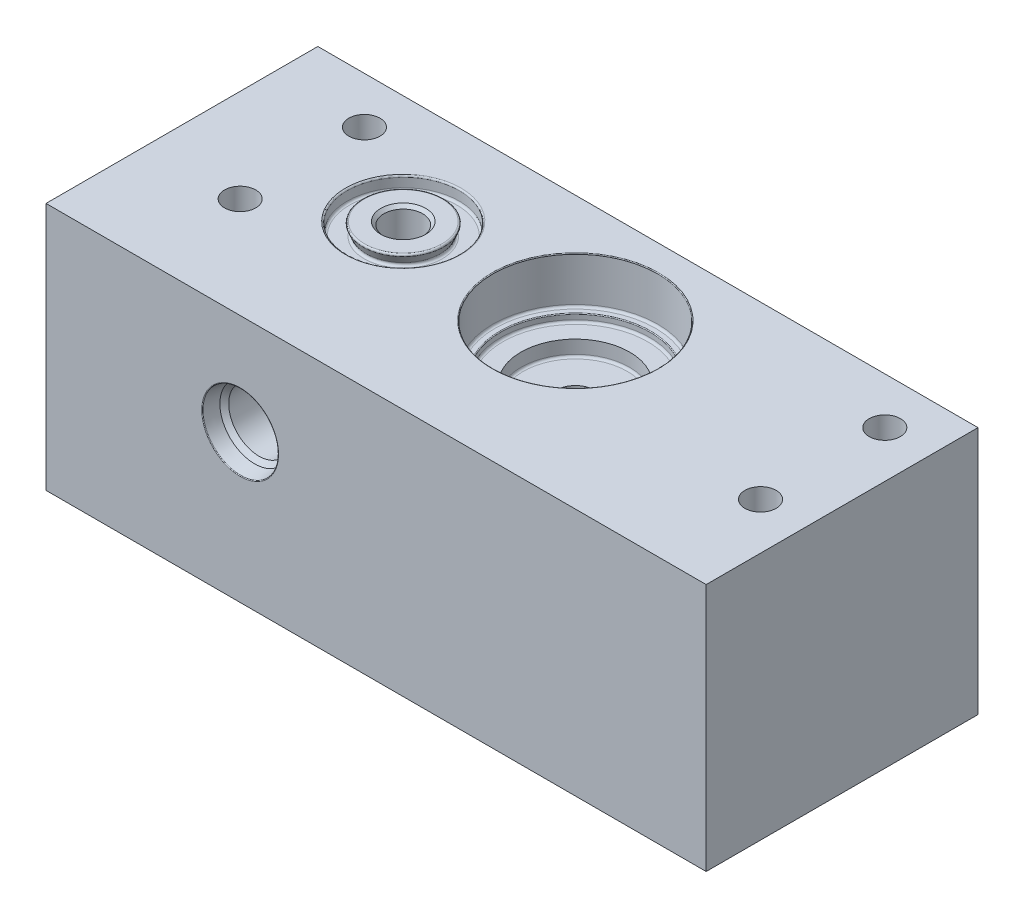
from build123d import *

# Parameters (mm, degrees)
SKETCH1_W                            = 107.95
SKETCH1_H                            = 40.64
BLOCK_DEPTH                          = 44.45
F_1_4_20_TAPPED_HOLE2_D              = 5.1054
F_1_4_CLEARANCE_HOLE_BACK_SIDE_D     = 6.5278
F_1_4_CLEARANCE_HOLE_BACK_SIDE_DEPTH = 22.86
F_1_4_CLEARANCE_HOLE_BACK_SIDE_TIP   = 1.961148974
PUMP_TO_TEST_LOCATION_R              = 3.175
CUT_EXTRUDE1_DEPTH                   = 24.638
SKETCH39_R                           = 13.4874
CHECK_VALVE_POCKET_DEPTH             = 8.89
CHECK_VALVE_INSTALLATION_STEP_START  = 1.27
SKETCH67_R                           = 13.4874
SKETCH67_R_2                         = 12.2174
CHECK_VALVE_INSTALLATION_STEP_DEPTH  = 1.27
SKETCH66_R                           = 8.89
CHECK_VALVE_UMBRELLA_CLEARANCE_DEPTH = 2.54
CONCAVE_TOOLING_RADIUS_R             = 0.381
CONVEX_EDGE_RADIUS_R                 = 0.127
VALVE_LAYOUT_W                       = 5.08
VALVE_LAYOUT_H                       = 28.575
SKETCH45_4_W                         = 6.0325
SKETCH45_4_H                         = 16.51
SKETCH45_5_W                         = 3.377031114
SKETCH45_5_H                         = 2.1082
DRAFT1_ANGLE                         = -24
FILLET1_R                            = 0.381
FILLET2_R                            = 0.254
CHAMFER3_SIZE                        = 0.508
F_1_4_0_25_DIAMETER_HOLE3_D          = 6.35
F_1_4_0_25_DIAMETER_HOLE3_DEPTH      = 26.67
F_1_4_0_25_DIAMETER_HOLE3_TIP        = 1.907732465
F_1_4_0_25_DIAMETER_HOLE1_D          = 6.35
F_1_4_0_25_DIAMETER_HOLE1_DEPTH      = 62.418732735
F_1_4_0_25_DIAMETER_HOLE1_TIP        = 1.907732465
F_1_4_0_25_DIAMETER_HOLE2_D          = 6.35
F_1_4_0_25_DIAMETER_HOLE2_DEPTH      = 16.51
F_1_4_0_25_DIAMETER_HOLE2_TIP        = 1.907732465
F_1_4_20_TAPPED_HOLE1_D              = 5.1054
F_1_4_20_TAPPED_HOLE1_DEPTH          = 12.954
FILLET3_R                            = 0.127
CHAMFER2_SIZE                        = 2.54
CHAMFER2_SIZE2                       = 0.924484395


with BuildPart() as part:
    # Sketch1 → block (new body)
    with BuildSketch(Plane.XY):
        with Locations((142.875, -20.32)):
            Rectangle(SKETCH1_W, SKETCH1_H)
    extrude(amount=BLOCK_DEPTH)

    # 1_4-20 Tapped Hole2 (through all)
    with Locations(Plane(origin=(0, 0, 0), x_dir=(1, 0, 0), z_dir=(0, 1, 0))):
        with Locations((104.14, -7.62), (104.14, -27.94), (189.23, -7.62), (189.23, -27.94)):
            Hole(F_1_4_20_TAPPED_HOLE2_D / 2)

    # 1_4 Clearance Hole back side
    with Locations(Plane(origin=(0, -40.64, 0), x_dir=(-1, 0, 0), z_dir=(0, -1, 0))):
        with Locations((-189.23, -7.62), (-189.23, -27.94), (-104.14, -27.94), (-104.14, -7.62)):
            Hole(F_1_4_CLEARANCE_HOLE_BACK_SIDE_D / 2, depth=F_1_4_CLEARANCE_HOLE_BACK_SIDE_DEPTH)
            with Locations((0, 0, -(F_1_4_CLEARANCE_HOLE_BACK_SIDE_DEPTH + F_1_4_CLEARANCE_HOLE_BACK_SIDE_TIP / 2))):  # 118° drill point
                Cone(0, F_1_4_CLEARANCE_HOLE_BACK_SIDE_D / 2, F_1_4_CLEARANCE_HOLE_BACK_SIDE_TIP, mode=Mode.SUBTRACT)

    # pump_to_test_location → Cut-Extrude1 (cut)
    with BuildSketch(Plane(origin=(0, 0, 0), x_dir=(-1, 0, 0), z_dir=(0, 1, 0))):
        with Locations(Location((-120.65, 17.78, 0), (0, 0, 90))):
            Circle(PUMP_TO_TEST_LOCATION_R)
    extrude(amount=-CUT_EXTRUDE1_DEPTH, mode=Mode.SUBTRACT)

    # Sketch39 → check_valve_pocket (cut)
    with BuildSketch(Plane(origin=(0, 0, 0), x_dir=(1, 0, 0), z_dir=(0, 1, 0))):
        with Locations(Location((148.7814652, -17.78, 0), (0, 0, 270))):
            Circle(SKETCH39_R)
    extrude(amount=-CHECK_VALVE_POCKET_DEPTH, mode=Mode.SUBTRACT)

    # Sketch67 → check_valve_installation_step (add)
    with BuildSketch(Plane(origin=(0, -8.89, 0), x_dir=(1, 0, 0), z_dir=(0, 1, 0)).offset(CHECK_VALVE_INSTALLATION_STEP_START)):
        with Locations(Location((148.7814652, -17.78, 0), (0, 0, 270))):
            Circle(SKETCH67_R)
        with Locations(Location((148.7814652, -17.78, 0), (0, 0, 270))):
            Circle(SKETCH67_R_2, mode=Mode.SUBTRACT)
    extrude(amount=-CHECK_VALVE_INSTALLATION_STEP_DEPTH)

    # Sketch66 → check_valve_umbrella_clearance (cut)
    with BuildSketch(Plane.XZ.offset(8.89)):
        with Locations(Location((148.7814652, 17.78, 0), (0, 0, 270))):
            Circle(SKETCH66_R)
    extrude(amount=CHECK_VALVE_UMBRELLA_CLEARANCE_DEPTH, mode=Mode.SUBTRACT)

    # concave_tooling_radius
    concave_tooling_radius_edges = [part.edges().sort_by_distance(p)[0] for p in [
        (148.7814652, -8.89, 5.5626),
        (148.7814652, -7.62, 4.2926),
        (148.7814652, -11.43, 26.67),
    ]]
    fillet(concave_tooling_radius_edges, radius=CONCAVE_TOOLING_RADIUS_R)

    # convex_edge_radius
    convex_edge_radius_edges = [part.edges().sort_by_distance(p)[0] for p in [
        (148.7814652, 0, 4.2926),
        (148.7814652, -7.62, 5.5626),
    ]]
    fillet(convex_edge_radius_edges, radius=CONVEX_EDGE_RADIUS_R)

    # valve_layout → Cut-Revolve6 (revolve, cut)
    with BuildSketch(Plane.XY.offset(17.78), mode=Mode.PRIVATE) as cut_revolve6_sk:
        with Locations((123.19, -26.3525)):
            Rectangle(VALVE_LAYOUT_W, VALVE_LAYOUT_H)
    revolve(cut_revolve6_sk.sketch.rotate(Axis((120.65, 0, 17.78), (0, -1, 0)), 90), axis=Axis((120.65, 0, 17.78), (0, -1, 0)), mode=Mode.SUBTRACT)

    # Sketch45_3 → internal_o-ring (revolve, cut)
    with BuildSketch(Plane.XY.offset(17.78), mode=Mode.PRIVATE) as internal_o_ring_sk:
        Polygon((120.65, -4.481472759), (120.65, -12.065), (125.73, -12.065), (123.698, -4.481472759), align=None)
    revolve(internal_o_ring_sk.sketch.rotate(Axis((120.65, 0, 17.78), (0, -1, 0)), 90), axis=Axis((120.65, 0, 17.78), (0, -1, 0)), mode=Mode.SUBTRACT)

    # Sketch45_4 → Cut-Revolve7 (revolve, cut)
    with BuildSketch(Plane.XY.offset(17.78), mode=Mode.PRIVATE) as cut_revolve7_sk:
        with Locations((128.74625, -32.385)):
            Rectangle(SKETCH45_4_W, SKETCH45_4_H)
    revolve(cut_revolve7_sk.sketch.rotate(Axis((120.65, 0, 17.78), (0, -1, 0)), 180), axis=Axis((120.65, 0, 17.78), (0, -1, 0)), mode=Mode.SUBTRACT)

    # Sketch45_5 → oring_groove_2-112 (revolve, cut)
    with BuildSketch(Plane.XY.offset(17.78), mode=Mode.PRIVATE) as oring_groove_2_112_sk:
        with Locations((128.143, -1.0541)):
            Rectangle(SKETCH45_5_W, SKETCH45_5_H)
    revolve(oring_groove_2_112_sk.sketch.rotate(Axis((120.65, 0, 17.78), (0, -1, 0)), 180), axis=Axis((120.65, 0, 17.78), (0, -1, 0)), mode=Mode.SUBTRACT)

    # Draft1
    draft1_faces = [part.faces().sort_by_distance(p)[0] for p in [
        (126.454484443, -1.0541, 17.78),
    ]]
    draft(draft1_faces, Plane(origin=(126.454484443, -2.1082, 17.78), x_dir=(1, 0, 0), z_dir=(0, 1, 0)), DRAFT1_ANGLE)

    # Fillet1
    fillet1_edges = [part.edges().sort_by_distance(p)[0] for p in [
        (126.454484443, -2.1082, 17.78),
        (129.831515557, -2.1082, 17.78),
    ]]
    fillet(fillet1_edges, radius=FILLET1_R)

    # Fillet2
    fillet2_edges = [part.edges().sort_by_distance(p)[0] for p in [
        (127.393115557, 0, 17.78),
        (129.831515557, 0, 17.78),
    ]]
    fillet(fillet2_edges, radius=FILLET2_R)

    # Chamfer3
    chamfer3_edges = [part.edges().sort_by_distance(p)[0] for p in [
        (120.65, 0, 14.605),
    ]]
    chamfer(chamfer3_edges, length=CHAMFER3_SIZE)

    # 1_4 _0.25_ Diameter Hole3
    with Locations(Plane.XY.offset(44.45)):
        with Locations((120.65, -16.51)):
            Hole(F_1_4_0_25_DIAMETER_HOLE3_D / 2, depth=F_1_4_0_25_DIAMETER_HOLE3_DEPTH)
            with Locations((0, 0, -(F_1_4_0_25_DIAMETER_HOLE3_DEPTH + F_1_4_0_25_DIAMETER_HOLE3_TIP / 2))):  # 118° drill point
                Cone(0, F_1_4_0_25_DIAMETER_HOLE3_D / 2, F_1_4_0_25_DIAMETER_HOLE3_TIP, mode=Mode.SUBTRACT)

    # Sketch3 → SAE_4 (revolve, cut)
    with BuildSketch(Plane(origin=(120.65, -16.51, 44.45), x_dir=(0, -1, 0), z_dir=(1, 0, 0))):
        Polygon((0, 0), (0, 13.8938), (4.96062, 13.8938), (4.96062, 3.08437889), (5.68279889, 2.3622), (6.1849, 0), align=None)
    revolve(axis=Axis((120.65, -16.51, 50.895314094), (0, 0, -1)), mode=Mode.SUBTRACT)

    # 1_4 _0.25_ Diameter Hole1
    with Locations(Plane.ZY.offset(-88.9)):
        with Locations((17.78, -16.51)):
            Hole(F_1_4_0_25_DIAMETER_HOLE1_D / 2, depth=F_1_4_0_25_DIAMETER_HOLE1_DEPTH)
            with Locations((0, 0, -(F_1_4_0_25_DIAMETER_HOLE1_DEPTH + F_1_4_0_25_DIAMETER_HOLE1_TIP / 2))):  # 118° drill point
                Cone(0, F_1_4_0_25_DIAMETER_HOLE1_D / 2, F_1_4_0_25_DIAMETER_HOLE1_TIP, mode=Mode.SUBTRACT)

    # Sketch310 → SAE_4 Port 2 (revolve, cut)
    with BuildSketch(Plane(origin=(88.9, -16.51, 17.78), x_dir=(0, 0, 1), z_dir=(0, 1, 0))):
        Polygon((0, 0), (0, 13.8938), (4.96062, 13.8938), (4.96062, 3.08437889), (5.68279889, 2.3622), (6.1849, 0), align=None)
    revolve(axis=Axis((82.454685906, -16.51, 17.78), (1, 0, 0)), mode=Mode.SUBTRACT)

    # 1_4 _0.25_ Diameter Hole2
    with Locations(Plane(origin=(0, 0, 0), x_dir=(1, 0, 0), z_dir=(0, 1, 0))):
        with Locations((148.7814652, -17.78)):
            Hole(F_1_4_0_25_DIAMETER_HOLE2_D / 2, depth=F_1_4_0_25_DIAMETER_HOLE2_DEPTH)
            with Locations((0, 0, -(F_1_4_0_25_DIAMETER_HOLE2_DEPTH + F_1_4_0_25_DIAMETER_HOLE2_TIP / 2))):  # 118° drill point
                Cone(0, F_1_4_0_25_DIAMETER_HOLE2_D / 2, F_1_4_0_25_DIAMETER_HOLE2_TIP, mode=Mode.SUBTRACT)

    # 1_4-20 Tapped Hole1
    with Locations(Plane(origin=(0, -40.64, 0), x_dir=(-1, 0, 0), z_dir=(0, -1, 0))):
        with Locations((-93.6625, -17.78), (-147.6375, -17.78)):
            Hole(F_1_4_20_TAPPED_HOLE1_D / 2, depth=F_1_4_20_TAPPED_HOLE1_DEPTH)

    # Fillet3
    fillet3_edges = [part.edges().sort_by_distance(p)[0] for p in [
        (120.65, -10.3251, 44.45),
        (88.9, -16.51, 11.5951),
    ]]
    fillet(fillet3_edges, radius=FILLET3_R)

    # Chamfer2
    chamfer2_edges = [part.edges().sort_by_distance(p)[0] for p in [
        (131.7625, -40.64, 17.78),
    ]]
    chamfer2_side = [part.faces().sort_by_distance(p)[0] for p in [
        (131.7625, -32.385, 17.78),
    ]]
    chamfer(chamfer2_edges, length=CHAMFER2_SIZE, length2=CHAMFER2_SIZE2, reference=chamfer2_side[0])


solid = part.part
